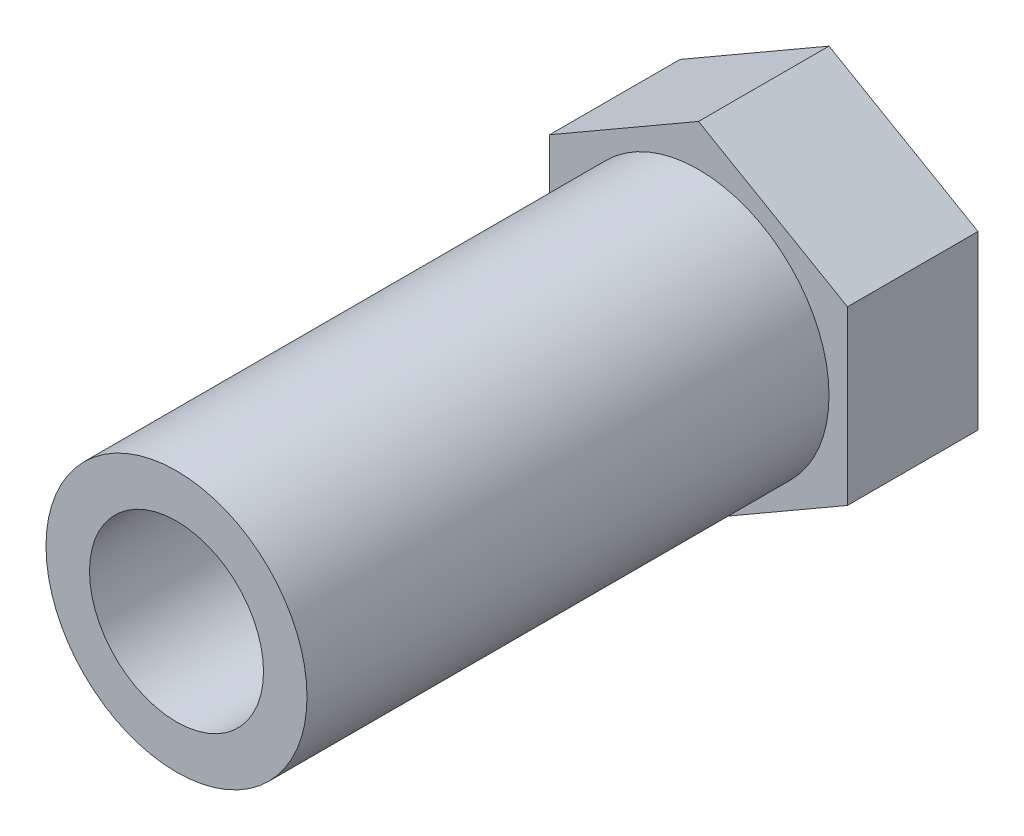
from build123d import *

# Parameters (mm, degrees)
EXTRUDE_1_DEPTH     = 6
SKETCH_2_R          = 6
EXTRUDE_2_DEPTH     = 24
SKETCH_3_R          = 4
CUT_EXTRUDE_1_DEPTH = 24


with BuildPart() as part:
    # Sketch 1 → Extrude 1 (new body)
    with BuildSketch(Plane.XY):
        Polygon((0, 7.909698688), (-6.85, 3.954849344), (-6.85, -3.954849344), (0, -7.909698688), (6.85, -3.954849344), (6.85, 3.954849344), align=None)
    extrude(amount=EXTRUDE_1_DEPTH)

    # Sketch 2 → Extrude 2 (add)
    with BuildSketch(Plane.XY.offset(6)):
        Circle(SKETCH_2_R)
    extrude(amount=EXTRUDE_2_DEPTH)

    # Sketch 3 → Cut-Extrude 1 (cut)
    with BuildSketch(Plane.XY.offset(30)):
        Circle(SKETCH_3_R)
    extrude(amount=-CUT_EXTRUDE_1_DEPTH, mode=Mode.SUBTRACT)


solid = part.part
